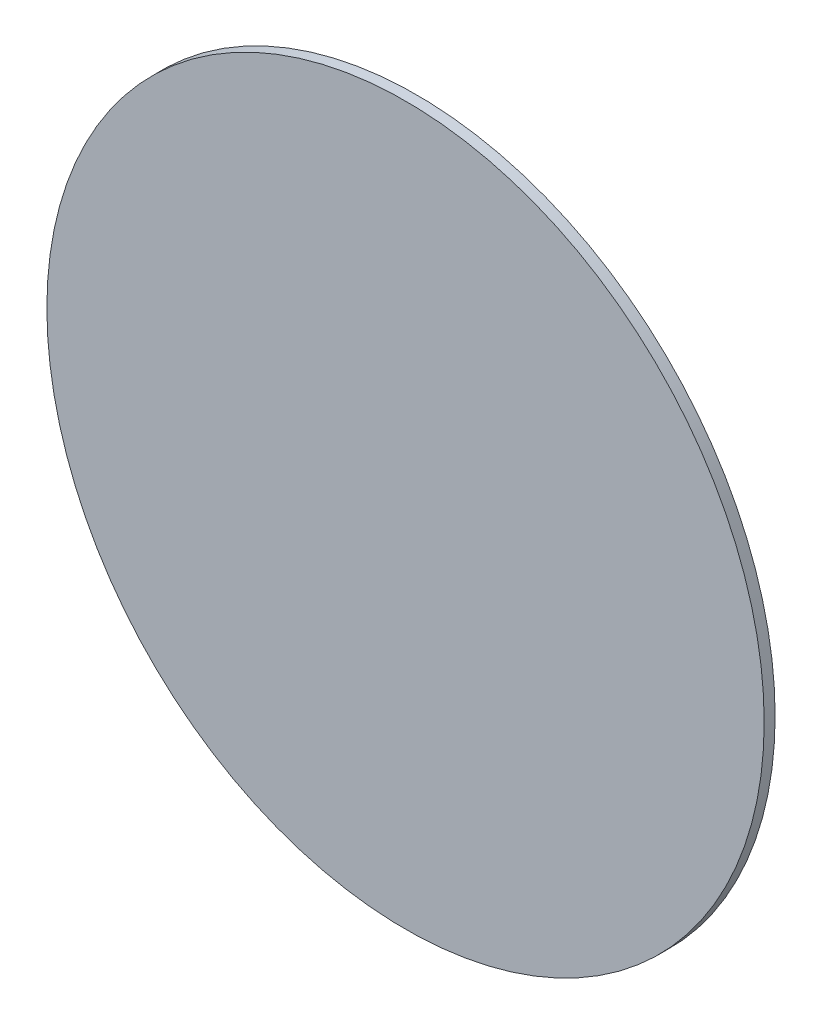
ISO-10303-21;
HEADER;
FILE_DESCRIPTION(('STEP AP214'),'2;1');
FILE_NAME('part.step','',(''),(''),'','','');
FILE_SCHEMA(('AUTOMOTIVE_DESIGN { 1 0 10303 214 1 1 1 1 }'));
ENDSEC;
DATA;
#1=APPLICATION_CONTEXT('core data for automotive mechanical design processes');
#2=APPLICATION_PROTOCOL_DEFINITION('international standard','automotive_design',2000,#1);
#3=PRODUCT_CONTEXT('',#1,'mechanical');
#4=PRODUCT('Part','Part','',(#3));
#5=PRODUCT_RELATED_PRODUCT_CATEGORY('part','',(#4));
#6=PRODUCT_DEFINITION_FORMATION('','',#4);
#7=PRODUCT_DEFINITION_CONTEXT('part definition',#1,'design');
#8=PRODUCT_DEFINITION('design','',#6,#7);
#9=PRODUCT_DEFINITION_SHAPE('','',#8);
#10=(LENGTH_UNIT() NAMED_UNIT(*) SI_UNIT(.MILLI.,.METRE.));
#11=(NAMED_UNIT(*) PLANE_ANGLE_UNIT() SI_UNIT($,.RADIAN.));
#12=(NAMED_UNIT(*) SI_UNIT($,.STERADIAN.) SOLID_ANGLE_UNIT());
#13=UNCERTAINTY_MEASURE_WITH_UNIT(LENGTH_MEASURE(1.E-05),#10,'distance_accuracy_value','');
#14=(GEOMETRIC_REPRESENTATION_CONTEXT(3) GLOBAL_UNCERTAINTY_ASSIGNED_CONTEXT((#13)) GLOBAL_UNIT_ASSIGNED_CONTEXT((#10,
#11,#12)) REPRESENTATION_CONTEXT('',''));
#15=CARTESIAN_POINT('',(0.,0.,0.));
#16=DIRECTION('',(0.,0.,1.));
#17=DIRECTION('',(1.,0.,0.));
#18=AXIS2_PLACEMENT_3D('',#15,#16,#17);
#19=CARTESIAN_POINT('',(0.,0.,0.12192));
#20=DIRECTION('',(0.,0.,-1.));
#21=DIRECTION('',(-1.,0.,0.));
#22=AXIS2_PLACEMENT_3D('',#19,#20,#21);
#23=CYLINDRICAL_SURFACE('',#22,4.);
#24=CARTESIAN_POINT('',(0.,0.,0.12192));
#25=DIRECTION('',(0.,0.,1.));
#26=DIRECTION('',(1.,0.,0.));
#27=AXIS2_PLACEMENT_3D('',#24,#25,#26);
#28=CIRCLE('',#27,4.);
#29=CARTESIAN_POINT('',(-4.,0.,0.12192));
#30=VERTEX_POINT('',#29);
#31=EDGE_CURVE('E10',#30,#30,#28,.T.);
#32=CARTESIAN_POINT('',(0.,0.,0.));
#33=DIRECTION('',(0.,0.,1.));
#34=DIRECTION('',(1.,0.,0.));
#35=AXIS2_PLACEMENT_3D('',#32,#33,#34);
#36=CIRCLE('',#35,4.);
#37=CARTESIAN_POINT('',(-4.,0.,0.));
#38=VERTEX_POINT('',#37);
#39=EDGE_CURVE('E31',#38,#38,#36,.T.);
#40=CARTESIAN_POINT('',(-4.,0.,0.12192));
#41=CARTESIAN_POINT('',(-4.,0.,0.12065));
#42=CARTESIAN_POINT('',(-4.,0.,0.11938));
#43=CARTESIAN_POINT('',(-4.,0.,0.11684));
#44=CARTESIAN_POINT('',(-4.,0.,0.11557));
#45=CARTESIAN_POINT('',(-4.,0.,0.11303));
#46=CARTESIAN_POINT('',(-4.,0.,0.11176));
#47=CARTESIAN_POINT('',(-4.,0.,0.10922));
#48=CARTESIAN_POINT('',(-4.,0.,0.10795));
#49=CARTESIAN_POINT('',(-4.,0.,0.10541));
#50=CARTESIAN_POINT('',(-4.,0.,0.10414));
#51=CARTESIAN_POINT('',(-4.,0.,0.1016));
#52=CARTESIAN_POINT('',(-4.,0.,0.10033));
#53=CARTESIAN_POINT('',(-4.,0.,0.09779));
#54=CARTESIAN_POINT('',(-4.,0.,0.09652));
#55=CARTESIAN_POINT('',(-4.,0.,0.09398));
#56=CARTESIAN_POINT('',(-4.,0.,0.09271));
#57=CARTESIAN_POINT('',(-4.,0.,0.09017));
#58=CARTESIAN_POINT('',(-4.,0.,0.0889));
#59=CARTESIAN_POINT('',(-4.,0.,0.08636));
#60=CARTESIAN_POINT('',(-4.,0.,0.08509));
#61=CARTESIAN_POINT('',(-4.,0.,0.08255));
#62=CARTESIAN_POINT('',(-4.,0.,0.08128));
#63=CARTESIAN_POINT('',(-4.,0.,0.07874));
#64=CARTESIAN_POINT('',(-4.,0.,0.07747));
#65=CARTESIAN_POINT('',(-4.,0.,0.07493));
#66=CARTESIAN_POINT('',(-4.,0.,0.07366));
#67=CARTESIAN_POINT('',(-4.,0.,0.07112));
#68=CARTESIAN_POINT('',(-4.,0.,0.06985));
#69=CARTESIAN_POINT('',(-4.,0.,0.06731));
#70=CARTESIAN_POINT('',(-4.,0.,0.06604));
#71=CARTESIAN_POINT('',(-4.,0.,0.0635));
#72=CARTESIAN_POINT('',(-4.,0.,0.06223));
#73=CARTESIAN_POINT('',(-4.,0.,0.05969));
#74=CARTESIAN_POINT('',(-4.,0.,0.05842));
#75=CARTESIAN_POINT('',(-4.,0.,0.05588));
#76=CARTESIAN_POINT('',(-4.,0.,0.05461));
#77=CARTESIAN_POINT('',(-4.,0.,0.05207));
#78=CARTESIAN_POINT('',(-4.,0.,0.0508));
#79=CARTESIAN_POINT('',(-4.,0.,0.04826));
#80=CARTESIAN_POINT('',(-4.,0.,0.04699));
#81=CARTESIAN_POINT('',(-4.,0.,0.04445));
#82=CARTESIAN_POINT('',(-4.,0.,0.04318));
#83=CARTESIAN_POINT('',(-4.,0.,0.04064));
#84=CARTESIAN_POINT('',(-4.,0.,0.03937));
#85=CARTESIAN_POINT('',(-4.,0.,0.03683));
#86=CARTESIAN_POINT('',(-4.,0.,0.03556));
#87=CARTESIAN_POINT('',(-4.,0.,0.03302));
#88=CARTESIAN_POINT('',(-4.,0.,0.03175));
#89=CARTESIAN_POINT('',(-4.,0.,0.02921));
#90=CARTESIAN_POINT('',(-4.,0.,0.02794));
#91=CARTESIAN_POINT('',(-4.,0.,0.0254));
#92=CARTESIAN_POINT('',(-4.,0.,0.02413));
#93=CARTESIAN_POINT('',(-4.,0.,0.02159));
#94=CARTESIAN_POINT('',(-4.,0.,0.02032));
#95=CARTESIAN_POINT('',(-4.,0.,0.01778));
#96=CARTESIAN_POINT('',(-4.,0.,0.01651));
#97=CARTESIAN_POINT('',(-4.,0.,0.01397));
#98=CARTESIAN_POINT('',(-4.,0.,0.0127));
#99=CARTESIAN_POINT('',(-4.,0.,0.01016));
#100=CARTESIAN_POINT('',(-4.,0.,0.00888999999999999));
#101=CARTESIAN_POINT('',(-4.,0.,0.00634999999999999));
#102=CARTESIAN_POINT('',(-4.,0.,0.00507999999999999));
#103=CARTESIAN_POINT('',(-4.,0.,0.00253999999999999));
#104=CARTESIAN_POINT('',(-4.,0.,0.00126999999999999));
#105=CARTESIAN_POINT('',(-4.,0.,0.));
#106=B_SPLINE_CURVE_WITH_KNOTS('',3,(#40,#41,#42,#43,#44,#45,#46,#47,#48,#49,#50,#51,#52,#53,
#54,#55,#56,#57,#58,#59,#60,#61,#62,#63,#64,#65,#66,#67,#68,#69,#70,#71,#72,#73,#74,#75,#76,#77,
#78,#79,#80,#81,#82,#83,#84,#85,#86,#87,#88,#89,#90,#91,#92,#93,#94,#95,#96,#97,#98,#99,#100,
#101,#102,#103,#104,#105),.UNSPECIFIED.,.F.,.F.,(4,2,2,2,2,2,2,2,2,2,2,2,2,2,2,2,2,2,2,2,2,2,2,
2,2,2,2,2,2,2,2,2,4),(0.,0.00380999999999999,0.00762,0.01143,0.01524,0.01905,0.02286,0.02667,
0.03048,0.03429,0.0381,0.04191,0.04572,0.04953,0.05334,0.05715,0.06096,0.06477,0.06858,0.07239,
0.0762,0.08001,0.08382,0.08763,0.09144,0.09525,0.09906,0.10287,0.10668,0.11049,0.1143,0.11811,
0.12192),.UNSPECIFIED.);
#107=EDGE_CURVE('BSEAM28',#30,#38,#106,.T.);
#108=ORIENTED_EDGE('',*,*,#31,.F.);
#109=ORIENTED_EDGE('',*,*,#39,.T.);
#110=ORIENTED_EDGE('',*,*,#107,.T.);
#111=ORIENTED_EDGE('',*,*,#107,.F.);
#112=EDGE_LOOP('',(#108,#110,#109,#111));
#113=FACE_BOUND('',#112,.T.);
#114=ADVANCED_FACE('F28',(#113),#23,.T.);
#115=CARTESIAN_POINT('',(0.,0.,0.12192));
#116=DIRECTION('',(0.,0.,1.));
#117=DIRECTION('',(1.,0.,0.));
#118=AXIS2_PLACEMENT_3D('',#115,#116,#117);
#119=PLANE('',#118);
#120=ORIENTED_EDGE('',*,*,#31,.T.);
#121=EDGE_LOOP('',(#120));
#122=FACE_BOUND('',#121,.T.);
#123=ADVANCED_FACE('F43',(#122),#119,.T.);
#124=CARTESIAN_POINT('',(0.,0.,0.));
#125=DIRECTION('',(0.,0.,1.));
#126=DIRECTION('',(1.,0.,0.));
#127=AXIS2_PLACEMENT_3D('',#124,#125,#126);
#128=PLANE('',#127);
#129=ORIENTED_EDGE('',*,*,#39,.F.);
#130=EDGE_LOOP('',(#129));
#131=FACE_BOUND('',#130,.T.);
#132=ADVANCED_FACE('F41',(#131),#128,.F.);
#133=CLOSED_SHELL('',(#114,#123,#132));
#134=MANIFOLD_SOLID_BREP('B2',#133);
#135=ADVANCED_BREP_SHAPE_REPRESENTATION('',(#18,#134),#14);
#136=SHAPE_DEFINITION_REPRESENTATION(#9,#135);
ENDSEC;
END-ISO-10303-21;
